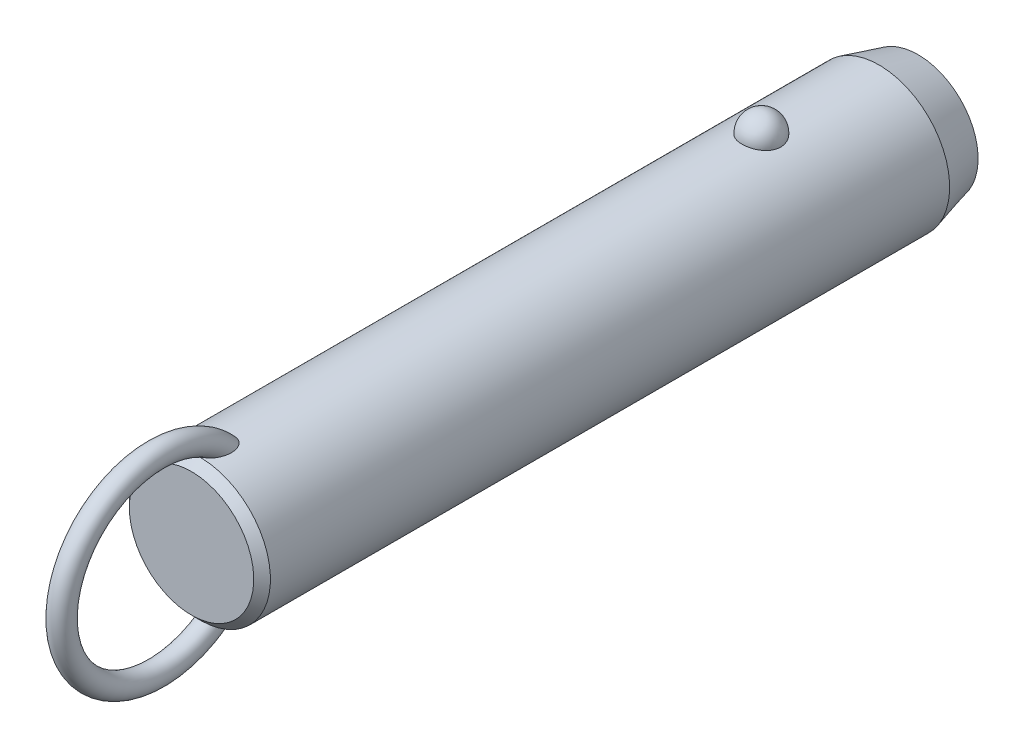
ISO-10303-21;
HEADER;
FILE_DESCRIPTION(('STEP AP214'),'2;1');
FILE_NAME('part.step','',(''),(''),'','','');
FILE_SCHEMA(('AUTOMOTIVE_DESIGN { 1 0 10303 214 1 1 1 1 }'));
ENDSEC;
DATA;
#1=APPLICATION_CONTEXT('core data for automotive mechanical design processes');
#2=APPLICATION_PROTOCOL_DEFINITION('international standard','automotive_design',2000,#1);
#3=PRODUCT_CONTEXT('',#1,'mechanical');
#4=PRODUCT('Part','Part','',(#3));
#5=PRODUCT_RELATED_PRODUCT_CATEGORY('part','',(#4));
#6=PRODUCT_DEFINITION_FORMATION('','',#4);
#7=PRODUCT_DEFINITION_CONTEXT('part definition',#1,'design');
#8=PRODUCT_DEFINITION('design','',#6,#7);
#9=PRODUCT_DEFINITION_SHAPE('','',#8);
#10=(LENGTH_UNIT() NAMED_UNIT(*) SI_UNIT(.MILLI.,.METRE.));
#11=(NAMED_UNIT(*) PLANE_ANGLE_UNIT() SI_UNIT($,.RADIAN.));
#12=(NAMED_UNIT(*) SI_UNIT($,.STERADIAN.) SOLID_ANGLE_UNIT());
#13=UNCERTAINTY_MEASURE_WITH_UNIT(LENGTH_MEASURE(1.E-05),#10,'distance_accuracy_value','');
#14=(GEOMETRIC_REPRESENTATION_CONTEXT(3) GLOBAL_UNCERTAINTY_ASSIGNED_CONTEXT((#13)) GLOBAL_UNIT_ASSIGNED_CONTEXT((#10,
#11,#12)) REPRESENTATION_CONTEXT('',''));
#15=CARTESIAN_POINT('',(0.,0.,0.));
#16=DIRECTION('',(0.,0.,1.));
#17=DIRECTION('',(1.,0.,0.));
#18=AXIS2_PLACEMENT_3D('',#15,#16,#17);
#19=CARTESIAN_POINT('',(0.,0.,86.4));
#20=DIRECTION('',(0.,0.,-1.));
#21=DIRECTION('',(-1.,0.,0.));
#22=AXIS2_PLACEMENT_3D('',#19,#20,#21);
#23=CYLINDRICAL_SURFACE('',#22,12.7);
#24=CARTESIAN_POINT('',(3.46661256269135,12.2177165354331,-3.5));
#25=CARTESIAN_POINT('',(3.4666090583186,12.2177194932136,-3.30432790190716));
#26=CARTESIAN_POINT('',(3.45063567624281,12.2222841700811,-3.10861112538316));
#27=CARTESIAN_POINT('',(3.38712451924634,12.2400345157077,-2.72271899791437));
#28=CARTESIAN_POINT('',(3.33957415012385,12.2532236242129,-2.53254588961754));
#29=CARTESIAN_POINT('',(3.2141234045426,12.286724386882,-2.16324948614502));
#30=CARTESIAN_POINT('',(3.13623639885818,12.3070329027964,-1.98412136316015));
#31=CARTESIAN_POINT('',(2.95205930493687,12.3525018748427,-1.64180592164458));
#32=CARTESIAN_POINT('',(2.84577003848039,12.3776621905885,-1.47861814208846));
#33=CARTESIAN_POINT('',(2.60688050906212,12.4301712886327,-1.17190583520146));
#34=CARTESIAN_POINT('',(2.47415697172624,12.4575299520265,-1.02847897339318));
#35=CARTESIAN_POINT('',(2.18615174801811,12.5112810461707,-0.766177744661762));
#36=CARTESIAN_POINT('',(2.03087002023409,12.5376734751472,-0.64730342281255));
#37=CARTESIAN_POINT('',(1.70237334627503,12.5864761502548,-0.437732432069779));
#38=CARTESIAN_POINT('',(1.52920948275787,12.6088972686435,-0.346958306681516));
#39=CARTESIAN_POINT('',(1.16944170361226,12.6473352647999,-0.195750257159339));
#40=CARTESIAN_POINT('',(0.982839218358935,12.663352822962,-0.135313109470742));
#41=CARTESIAN_POINT('',(0.604961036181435,12.6869706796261,-0.0473241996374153));
#42=CARTESIAN_POINT('',(0.413823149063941,12.6947125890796,-0.0192185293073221));
#43=CARTESIAN_POINT('',(0.0293827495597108,12.7014203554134,0.00517254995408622));
#44=CARTESIAN_POINT('',(-0.163919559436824,12.7003870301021,0.00146092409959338));
#45=CARTESIAN_POINT('',(-0.544374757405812,12.689735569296,-0.0373939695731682));
#46=CARTESIAN_POINT('',(-0.731575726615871,12.6802364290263,-0.0721015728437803));
#47=CARTESIAN_POINT('',(-1.09733277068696,12.6538333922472,-0.171364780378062));
#48=CARTESIAN_POINT('',(-1.27588869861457,12.6369293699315,-0.235920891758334));
#49=CARTESIAN_POINT('',(-1.6204698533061,12.5973946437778,-0.393548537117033));
#50=CARTESIAN_POINT('',(-1.78641865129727,12.5747321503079,-0.486778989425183));
#51=CARTESIAN_POINT('',(-2.10030671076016,12.5261316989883,-0.699110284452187));
#52=CARTESIAN_POINT('',(-2.24824419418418,12.5001934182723,-0.818213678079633));
#53=CARTESIAN_POINT('',(-2.52491489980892,12.4472906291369,-1.08157124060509));
#54=CARTESIAN_POINT('',(-2.65324222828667,12.4203160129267,-1.22624992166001));
#55=CARTESIAN_POINT('',(-2.88410007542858,12.3687509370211,-1.53528325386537));
#56=CARTESIAN_POINT('',(-2.98662883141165,12.3441606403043,-1.69963924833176));
#57=CARTESIAN_POINT('',(-3.16432417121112,12.2998199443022,-2.04548497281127));
#58=CARTESIAN_POINT('',(-3.23917525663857,12.2801261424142,-2.22714424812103));
#59=CARTESIAN_POINT('',(-3.35800573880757,12.248167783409,-2.6009138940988));
#60=CARTESIAN_POINT('',(-3.4019860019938,12.2359030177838,-2.79302397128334));
#61=CARTESIAN_POINT('',(-3.45784812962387,12.2202347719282,-3.18140279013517));
#62=CARTESIAN_POINT('',(-3.46986123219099,12.2167950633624,-3.37765118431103));
#63=CARTESIAN_POINT('',(-3.46186273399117,12.2190638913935,-3.76943689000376));
#64=CARTESIAN_POINT('',(-3.44185196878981,12.2247721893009,-3.96497421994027));
#65=CARTESIAN_POINT('',(-3.37048652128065,12.2446381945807,-4.34881728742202));
#66=CARTESIAN_POINT('',(-3.31928253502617,12.2587552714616,-4.53715319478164));
#67=CARTESIAN_POINT('',(-3.18693461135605,12.2938237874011,-4.90231727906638));
#68=CARTESIAN_POINT('',(-3.1057895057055,12.3147754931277,-5.07914500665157));
#69=CARTESIAN_POINT('',(-2.91506431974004,12.3613125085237,-5.41732059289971));
#70=CARTESIAN_POINT('',(-2.80533587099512,12.3869217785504,-5.57858147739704));
#71=CARTESIAN_POINT('',(-2.560414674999,12.4398525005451,-5.88013283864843));
#72=CARTESIAN_POINT('',(-2.42522099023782,12.4671740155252,-6.02042254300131));
#73=CARTESIAN_POINT('',(-2.1323357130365,12.5205965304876,-6.27662798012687));
#74=CARTESIAN_POINT('',(-1.97456596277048,12.5466928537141,-6.3924554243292));
#75=CARTESIAN_POINT('',(-1.64115839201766,12.5946384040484,-6.59583547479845));
#76=CARTESIAN_POINT('',(-1.46552179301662,12.6164879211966,-6.68339001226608));
#77=CARTESIAN_POINT('',(-1.10356050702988,12.6532533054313,-6.82682153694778));
#78=CARTESIAN_POINT('',(-0.917391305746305,12.6682500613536,-6.8830698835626));
#79=CARTESIAN_POINT('',(-0.537836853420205,12.6900288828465,-6.96386887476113));
#80=CARTESIAN_POINT('',(-0.344452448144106,12.6968119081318,-6.9884232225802));
#81=CARTESIAN_POINT('',(0.0402577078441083,12.7013667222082,-7.00496469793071));
#82=CARTESIAN_POINT('',(0.231556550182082,12.6993008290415,-6.99753844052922));
#83=CARTESIAN_POINT('',(0.610105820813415,12.6867505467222,-6.9516636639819));
#84=CARTESIAN_POINT('',(0.797356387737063,12.6762664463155,-6.913216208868));
#85=CARTESIAN_POINT('',(1.16186657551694,12.6480587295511,-6.80658431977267));
#86=CARTESIAN_POINT('',(1.33915951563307,12.6303611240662,-6.73850666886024));
#87=CARTESIAN_POINT('',(1.67968518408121,12.5896027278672,-6.5745087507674));
#88=CARTESIAN_POINT('',(1.84291705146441,12.5665416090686,-6.47858678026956));
#89=CARTESIAN_POINT('',(2.15340192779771,12.5171072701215,-6.25982455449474));
#90=CARTESIAN_POINT('',(2.30037831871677,12.4906895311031,-6.13660186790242));
#91=CARTESIAN_POINT('',(2.5717412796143,12.4376567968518,-5.86739587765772));
#92=CARTESIAN_POINT('',(2.69612388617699,12.4110417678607,-5.72140858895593));
#93=CARTESIAN_POINT('',(2.92107785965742,12.360051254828,-5.40794137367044));
#94=CARTESIAN_POINT('',(3.02121329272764,12.3357209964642,-5.24014110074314));
#95=CARTESIAN_POINT('',(3.19236291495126,12.2925446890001,-4.88969865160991));
#96=CARTESIAN_POINT('',(3.26338839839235,12.2736965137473,-4.70706226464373));
#97=CARTESIAN_POINT('',(3.36788038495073,12.245404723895,-4.35469510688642));
#98=CARTESIAN_POINT('',(3.40484026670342,12.2351018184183,-4.18605935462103));
#99=CARTESIAN_POINT('',(3.45420764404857,12.2212564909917,-3.84496058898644));
#100=CARTESIAN_POINT('',(3.46661565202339,12.2177139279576,-3.67249765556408));
#101=CARTESIAN_POINT('',(3.46661256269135,12.2177165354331,-3.5));
#102=B_SPLINE_CURVE_WITH_KNOTS('',3,(#24,#25,#26,#27,#28,#29,#30,#31,#32,#33,#34,#35,#36,#37,
#38,#39,#40,#41,#42,#43,#44,#45,#46,#47,#48,#49,#50,#51,#52,#53,#54,#55,#56,#57,#58,#59,#60,#61,
#62,#63,#64,#65,#66,#67,#68,#69,#70,#71,#72,#73,#74,#75,#76,#77,#78,#79,#80,#81,#82,#83,#84,#85,
#86,#87,#88,#89,#90,#91,#92,#93,#94,#95,#96,#97,#98,#99,#100,#101),.UNSPECIFIED.,.T.,.F.,(4,2,2,
2,2,2,2,2,2,2,2,2,2,2,2,2,2,2,2,2,2,2,2,2,2,2,2,2,2,2,2,2,2,2,2,2,2,2,4),(0.,0.586396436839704,
1.17302689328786,1.7593990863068,2.34575431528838,2.93491084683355,3.52406845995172,
4.11158733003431,4.69904375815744,5.2762784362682,5.85345931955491,6.42265312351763,
6.99185659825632,7.56427334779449,8.136746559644,8.71981013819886,9.3029135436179,
9.89247258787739,10.4820150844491,11.0691335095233,11.6562366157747,12.2405256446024,
12.8248374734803,13.412244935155,13.9996740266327,14.5891883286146,15.1786623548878,
15.7609861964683,16.3432419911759,16.914863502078,17.4864654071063,18.056024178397,
18.6256177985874,19.2037609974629,19.7820055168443,20.3699810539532,20.9577282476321,
21.4746855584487,21.9916320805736),.UNSPECIFIED.);
#103=CARTESIAN_POINT('',(3.46661256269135,12.2177165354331,-3.5));
#104=VERTEX_POINT('',#103);
#105=EDGE_CURVE('E41',#104,#104,#102,.T.);
#106=ORIENTED_EDGE('',*,*,#105,.T.);
#107=EDGE_LOOP('',(#106));
#108=FACE_BOUND('',#107,.T.);
#109=CARTESIAN_POINT('',(0.,0.,97.6000000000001));
#110=DIRECTION('',(0.,0.,1.));
#111=DIRECTION('',(1.,0.,0.));
#112=AXIS2_PLACEMENT_3D('',#109,#110,#111);
#113=CIRCLE('',#112,12.7);
#114=CARTESIAN_POINT('',(-12.7,0.,97.6000000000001));
#115=VERTEX_POINT('',#114);
#116=EDGE_CURVE('E10',#115,#115,#113,.F.);
#117=ORIENTED_EDGE('',*,*,#116,.T.);
#118=EDGE_LOOP('',(#117));
#119=FACE_BOUND('',#118,.T.);
#120=CARTESIAN_POINT('',(-0.548122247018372,-12.6881662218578,91.3432187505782));
#121=CARTESIAN_POINT('',(-0.648865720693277,-12.6838128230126,91.377926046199));
#122=CARTESIAN_POINT('',(-0.746398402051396,-12.6783867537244,91.4220428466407));
#123=CARTESIAN_POINT('',(-0.932125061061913,-12.666091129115,91.5267647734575));
#124=CARTESIAN_POINT('',(-1.02030388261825,-12.6592192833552,91.587396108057));
#125=CARTESIAN_POINT('',(-1.18487740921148,-12.6448747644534,91.721847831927));
#126=CARTESIAN_POINT('',(-1.26134296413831,-12.637406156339,91.7955825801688));
#127=CARTESIAN_POINT('',(-1.4023120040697,-12.6225412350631,91.9536045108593));
#128=CARTESIAN_POINT('',(-1.46681470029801,-12.6151449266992,92.0378923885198));
#129=CARTESIAN_POINT('',(-1.60714786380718,-12.5981718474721,92.2496577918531));
#130=CARTESIAN_POINT('',(-1.67725126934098,-12.588900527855,92.380962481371));
#131=CARTESIAN_POINT('',(-1.79536591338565,-12.5725964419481,92.6532471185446));
#132=CARTESIAN_POINT('',(-1.84333535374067,-12.5655679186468,92.7942447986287));
#133=CARTESIAN_POINT('',(-1.93422576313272,-12.5519624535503,93.1376455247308));
#134=CARTESIAN_POINT('',(-1.96788773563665,-12.5466298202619,93.3425578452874));
#135=CARTESIAN_POINT('',(-1.9941399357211,-12.542463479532,93.6517600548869));
#136=CARTESIAN_POINT('',(-1.99883864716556,-12.5417153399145,93.7552987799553));
#137=CARTESIAN_POINT('',(-2.00078003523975,-12.5414074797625,93.9624512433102));
#138=CARTESIAN_POINT('',(-1.99802449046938,-12.5418474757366,94.0660649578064));
#139=CARTESIAN_POINT('',(-1.98336733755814,-12.5441750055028,94.3103207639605));
#140=CARTESIAN_POINT('',(-1.96851430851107,-12.5465291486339,94.4507804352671));
#141=CARTESIAN_POINT('',(-1.92707089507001,-12.5529612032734,94.7299607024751));
#142=CARTESIAN_POINT('',(-1.90047458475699,-12.5570399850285,94.8686803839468));
#143=CARTESIAN_POINT('',(-1.83619120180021,-12.5666008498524,95.1434113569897));
#144=CARTESIAN_POINT('',(-1.79850828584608,-12.57208240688,95.2794236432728));
#145=CARTESIAN_POINT('',(-1.71223796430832,-12.5841228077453,95.5478421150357));
#146=CARTESIAN_POINT('',(-1.66365679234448,-12.5906810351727,95.6802503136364));
#147=CARTESIAN_POINT('',(-1.5780450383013,-12.6016176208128,95.8854887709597));
#148=CARTESIAN_POINT('',(-1.54477252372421,-12.6057501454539,95.9599149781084));
#149=CARTESIAN_POINT('',(-1.47424480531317,-12.6141930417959,96.1068393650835));
#150=CARTESIAN_POINT('',(-1.43699041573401,-12.6185033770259,96.1793379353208));
#151=CARTESIAN_POINT('',(-1.35825795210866,-12.6272207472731,96.3218926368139));
#152=CARTESIAN_POINT('',(-1.31678520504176,-12.6316276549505,96.3919517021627));
#153=CARTESIAN_POINT('',(-1.22917793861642,-12.6404532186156,96.5290705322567));
#154=CARTESIAN_POINT('',(-1.18304514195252,-12.6448718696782,96.5961313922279));
#155=CARTESIAN_POINT('',(-1.07246411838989,-12.6547893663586,96.7438741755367));
#156=CARTESIAN_POINT('',(-1.00642239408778,-12.6602600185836,96.8233844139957));
#157=CARTESIAN_POINT('',(-0.864441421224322,-12.6707460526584,96.9731698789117));
#158=CARTESIAN_POINT('',(-0.788516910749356,-12.6757620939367,97.0434585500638));
#159=CARTESIAN_POINT('',(-0.652215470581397,-12.6833591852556,97.1486801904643));
#160=CARTESIAN_POINT('',(-0.594982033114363,-12.6861973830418,97.1876241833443));
#161=CARTESIAN_POINT('',(-0.475269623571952,-12.6912445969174,97.2564899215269));
#162=CARTESIAN_POINT('',(-0.412800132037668,-12.6934547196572,97.2864275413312));
#163=CARTESIAN_POINT('',(-0.295749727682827,-12.6966636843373,97.3297565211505));
#164=CARTESIAN_POINT('',(-0.241949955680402,-12.6978134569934,97.3452188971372));
#165=CARTESIAN_POINT('',(-0.132508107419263,-12.6994261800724,97.3668845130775));
#166=CARTESIAN_POINT('',(-0.076867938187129,-12.6998898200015,97.3730970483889));
#167=CARTESIAN_POINT('',(0.0347696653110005,-12.7000752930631,97.3755838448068));
#168=CARTESIAN_POINT('',(0.0907676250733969,-12.6997954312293,97.3718353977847));
#169=CARTESIAN_POINT('',(0.20128301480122,-12.6985255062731,97.3547883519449));
#170=CARTESIAN_POINT('',(0.255799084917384,-12.6975348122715,97.3414812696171));
#171=CARTESIAN_POINT('',(0.376042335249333,-12.6946091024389,97.3020379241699));
#172=CARTESIAN_POINT('',(0.44095085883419,-12.6924943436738,97.2734492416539));
#173=CARTESIAN_POINT('',(0.565350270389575,-12.6875639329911,97.2063234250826));
#174=CARTESIAN_POINT('',(0.624828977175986,-12.6847467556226,97.1677646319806));
#175=CARTESIAN_POINT('',(0.774116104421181,-12.6767252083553,97.056949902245));
#176=CARTESIAN_POINT('',(0.859449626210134,-12.6711344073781,96.9787605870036));
#177=CARTESIAN_POINT('',(1.01789440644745,-12.6593922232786,96.810943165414));
#178=CARTESIAN_POINT('',(1.09096902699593,-12.653239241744,96.721282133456));
#179=CARTESIAN_POINT('',(1.22268793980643,-12.6411674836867,96.5402658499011));
#180=CARTESIAN_POINT('',(1.28193986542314,-12.6352572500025,96.449345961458));
#181=CARTESIAN_POINT('',(1.39259777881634,-12.6235401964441,96.2627929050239));
#182=CARTESIAN_POINT('',(1.44399707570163,-12.6177334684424,96.1671558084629));
#183=CARTESIAN_POINT('',(1.53972870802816,-12.6064093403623,95.9722738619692));
#184=CARTESIAN_POINT('',(1.58405262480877,-12.6008922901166,95.8730248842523));
#185=CARTESIAN_POINT('',(1.66600705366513,-12.5903187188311,95.6717727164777));
#186=CARTESIAN_POINT('',(1.70363651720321,-12.5852622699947,95.5697690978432));
#187=CARTESIAN_POINT('',(1.77545379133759,-12.5753406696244,95.3543580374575));
#188=CARTESIAN_POINT('',(1.80903453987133,-12.5705328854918,95.240745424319));
#189=CARTESIAN_POINT('',(1.86844163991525,-12.5618400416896,95.0114575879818));
#190=CARTESIAN_POINT('',(1.89426665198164,-12.5579551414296,94.8957820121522));
#191=CARTESIAN_POINT('',(1.9378546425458,-12.5513030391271,94.6630072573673));
#192=CARTESIAN_POINT('',(1.95562640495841,-12.5485346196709,94.5459097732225));
#193=CARTESIAN_POINT('',(1.98264463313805,-12.5442934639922,94.3107473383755));
#194=CARTESIAN_POINT('',(1.99189298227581,-12.5428204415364,94.1926826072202));
#195=CARTESIAN_POINT('',(2.00416068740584,-12.540871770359,93.8806225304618));
#196=CARTESIAN_POINT('',(1.99944433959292,-12.541631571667,93.6862290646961));
#197=CARTESIAN_POINT('',(1.96113755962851,-12.5476846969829,93.3003095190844));
#198=CARTESIAN_POINT('',(1.92758341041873,-12.5529723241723,93.1087801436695));
#199=CARTESIAN_POINT('',(1.8393434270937,-12.5661532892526,92.7822728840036));
#200=CARTESIAN_POINT('',(1.79215440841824,-12.5730485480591,92.6452499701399));
#201=CARTESIAN_POINT('',(1.67676242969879,-12.588958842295,92.380445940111));
#202=CARTESIAN_POINT('',(1.60859050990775,-12.597970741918,92.2526515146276));
#203=CARTESIAN_POINT('',(1.46583832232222,-12.6152829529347,92.0358006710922));
#204=CARTESIAN_POINT('',(1.39525727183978,-12.6233659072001,91.9441050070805));
#205=CARTESIAN_POINT('',(1.23992594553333,-12.6395676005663,91.7734854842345));
#206=CARTESIAN_POINT('',(1.15517932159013,-12.6476863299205,91.6945583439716));
#207=CARTESIAN_POINT('',(0.971995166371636,-12.6630846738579,91.5526438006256));
#208=CARTESIAN_POINT('',(0.873456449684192,-12.6703572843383,91.4897849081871));
#209=CARTESIAN_POINT('',(0.665847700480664,-12.6829569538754,91.3844870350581));
#210=CARTESIAN_POINT('',(0.556784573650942,-12.688285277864,91.3420347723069));
#211=CARTESIAN_POINT('',(0.347338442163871,-12.6956226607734,91.2844434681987));
#212=CARTESIAN_POINT('',(0.247759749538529,-12.6979816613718,91.2663996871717));
#213=CARTESIAN_POINT('',(0.047021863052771,-12.7003077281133,91.2486007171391));
#214=CARTESIAN_POINT('',(-0.054135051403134,-12.7002779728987,91.2488212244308));
#215=CARTESIAN_POINT('',(-0.221414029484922,-12.6982482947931,91.2643639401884));
#216=CARTESIAN_POINT('',(-0.288055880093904,-12.6969033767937,91.2746662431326));
#217=CARTESIAN_POINT('',(-0.419599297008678,-12.6932369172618,91.3031348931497));
#218=CARTESIAN_POINT('',(-0.484501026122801,-12.6909154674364,91.3213005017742));
#219=CARTESIAN_POINT('',(-0.548122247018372,-12.6881662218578,91.3432187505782));
#220=B_SPLINE_CURVE_WITH_KNOTS('',3,(#120,#121,#122,#123,#124,#125,#126,#127,#128,#129,#130,
#131,#132,#133,#134,#135,#136,#137,#138,#139,#140,#141,#142,#143,#144,#145,#146,#147,#148,#149,
#150,#151,#152,#153,#154,#155,#156,#157,#158,#159,#160,#161,#162,#163,#164,#165,#166,#167,#168,
#169,#170,#171,#172,#173,#174,#175,#176,#177,#178,#179,#180,#181,#182,#183,#184,#185,#186,#187,
#188,#189,#190,#191,#192,#193,#194,#195,#196,#197,#198,#199,#200,#201,#202,#203,#204,#205,#206,
#207,#208,#209,#210,#211,#212,#213,#214,#215,#216,#217,#218,#219),.UNSPECIFIED.,.T.,.F.,(4,2,2,
2,2,2,2,2,2,2,2,2,2,2,2,2,2,2,2,2,2,2,2,2,2,2,2,2,2,2,2,2,2,2,2,2,2,2,2,2,2,2,2,2,2,2,2,2,2,4),
(0.,0.319642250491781,0.639794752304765,0.957927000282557,1.27608021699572,1.72100165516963,
2.16675988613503,2.78630021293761,3.0970578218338,3.40774128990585,3.83096358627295,
4.2543996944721,4.67767724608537,5.10071330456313,5.34550297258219,5.59024267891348,
5.8346770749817,6.07902143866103,6.38891080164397,6.69834321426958,6.90560910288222,
7.11250749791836,7.27977315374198,7.44687060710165,7.61434932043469,7.78197685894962,
7.99365544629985,8.20579780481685,8.55147335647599,8.89816429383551,9.22375138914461,
9.5496143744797,9.87586224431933,10.202161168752,10.557587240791,10.9130746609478,
11.2681734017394,11.6231936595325,12.2046601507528,12.7853961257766,13.219164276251,
13.6522938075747,13.9989174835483,14.3454519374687,14.6946768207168,15.0436740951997,
15.3457513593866,15.6474266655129,15.8493051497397,16.0511646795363),.UNSPECIFIED.);
#221=CARTESIAN_POINT('',(-0.548122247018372,-12.6881662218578,91.3432187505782));
#222=VERTEX_POINT('',#221);
#223=EDGE_CURVE('E59',#222,#222,#220,.T.);
#224=ORIENTED_EDGE('',*,*,#223,.T.);
#225=EDGE_LOOP('',(#224));
#226=FACE_BOUND('',#225,.T.);
#227=CARTESIAN_POINT('',(-0.548122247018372,12.6881662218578,91.3432187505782));
#228=CARTESIAN_POINT('',(-0.459436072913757,12.6919968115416,91.312673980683));
#229=CARTESIAN_POINT('',(-0.368189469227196,12.6949996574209,91.2893913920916));
#230=CARTESIAN_POINT('',(-0.183024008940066,12.6990186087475,91.2584062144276));
#231=CARTESIAN_POINT('',(-0.0891049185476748,12.7000345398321,91.2507049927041));
#232=CARTESIAN_POINT('',(0.0987147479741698,12.6999636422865,91.2512455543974));
#233=CARTESIAN_POINT('',(0.192615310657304,12.6988761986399,91.2594920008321));
#234=CARTESIAN_POINT('',(0.37765885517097,12.6947211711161,91.2915515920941));
#235=CARTESIAN_POINT('',(0.468801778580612,12.6916535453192,91.3153650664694));
#236=CARTESIAN_POINT('',(0.645809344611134,12.6838788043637,91.3774565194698));
#237=CARTESIAN_POINT('',(0.731679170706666,12.6791733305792,91.415720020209));
#238=CARTESIAN_POINT('',(0.896315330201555,12.6686004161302,91.5051204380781));
#239=CARTESIAN_POINT('',(0.975080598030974,12.6627328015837,91.5562592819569));
#240=CARTESIAN_POINT('',(1.12963655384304,12.6499161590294,91.6736782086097));
#241=CARTESIAN_POINT('',(1.20478673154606,12.6429194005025,91.7407929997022));
#242=CARTESIAN_POINT('',(1.34448241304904,12.6288282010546,91.8852250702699));
#243=CARTESIAN_POINT('',(1.40902173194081,12.621733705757,91.9625482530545));
#244=CARTESIAN_POINT('',(1.55208211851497,12.6050877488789,92.1592475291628));
#245=CARTESIAN_POINT('',(1.62510490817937,12.5957546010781,92.2826540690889));
#246=CARTESIAN_POINT('',(1.7501904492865,12.5789823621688,92.5397690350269));
#247=CARTESIAN_POINT('',(1.80221377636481,12.5715468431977,92.673496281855));
#248=CARTESIAN_POINT('',(1.90309965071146,12.5567434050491,92.9983516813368));
#249=CARTESIAN_POINT('',(1.94342317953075,12.5504515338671,93.1921611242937));
#250=CARTESIAN_POINT('',(1.99332997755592,12.5426147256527,93.5837881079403));
#251=CARTESIAN_POINT('',(2.00285305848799,12.5410790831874,93.7816127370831));
#252=CARTESIAN_POINT('',(1.99678999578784,12.5420407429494,94.1166427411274));
#253=CARTESIAN_POINT('',(1.98794117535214,12.5434564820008,94.2540428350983));
#254=CARTESIAN_POINT('',(1.95865119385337,12.5480641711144,94.5276394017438));
#255=CARTESIAN_POINT('',(1.9382043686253,12.5512569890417,94.6638352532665));
#256=CARTESIAN_POINT('',(1.88647896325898,12.5591352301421,94.9342493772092));
#257=CARTESIAN_POINT('',(1.85518800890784,12.5638223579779,95.0684652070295));
#258=CARTESIAN_POINT('',(1.78217886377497,12.5743868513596,95.3339362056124));
#259=CARTESIAN_POINT('',(1.74046509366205,12.5802637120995,95.4651926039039));
#260=CARTESIAN_POINT('',(1.66024095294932,12.5910571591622,95.6860855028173));
#261=CARTESIAN_POINT('',(1.62434772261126,12.5957535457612,95.7766904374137));
#262=CARTESIAN_POINT('',(1.54709009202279,12.6054762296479,95.9555125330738));
#263=CARTESIAN_POINT('',(1.50572681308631,12.6105024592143,96.0437301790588));
#264=CARTESIAN_POINT('',(1.41728020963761,12.620748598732,96.2169321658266));
#265=CARTESIAN_POINT('',(1.37021377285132,12.625967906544,96.3019251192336));
#266=CARTESIAN_POINT('',(1.2696962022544,12.6364721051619,96.4680072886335));
#267=CARTESIAN_POINT('',(1.21624929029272,12.6417569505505,96.5490990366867));
#268=CARTESIAN_POINT('',(1.10304413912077,12.6521331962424,96.7047027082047));
#269=CARTESIAN_POINT('',(1.04340936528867,12.657226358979,96.7793033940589));
#270=CARTESIAN_POINT('',(0.91591933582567,12.6670906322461,96.921324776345));
#271=CARTESIAN_POINT('',(0.848064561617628,12.6718617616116,96.9887458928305));
#272=CARTESIAN_POINT('',(0.717035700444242,12.67987711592,97.1006247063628));
#273=CARTESIAN_POINT('',(0.655526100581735,12.6832377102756,97.1469970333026));
#274=CARTESIAN_POINT('',(0.525985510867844,12.6892676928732,97.2296195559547));
#275=CARTESIAN_POINT('',(0.457969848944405,12.6919386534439,97.2658927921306));
#276=CARTESIAN_POINT('',(0.334859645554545,12.695691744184,97.3166572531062));
#277=CARTESIAN_POINT('',(0.281116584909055,12.6970073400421,97.3343733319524));
#278=CARTESIAN_POINT('',(0.171425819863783,12.6989609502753,97.3606429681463));
#279=CARTESIAN_POINT('',(0.115480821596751,12.699599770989,97.3692074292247));
#280=CARTESIAN_POINT('',(0.00272618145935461,12.7001251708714,97.3762531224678));
#281=CARTESIAN_POINT('',(-0.0540859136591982,12.7000089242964,97.3746964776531));
#282=CARTESIAN_POINT('',(-0.166544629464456,12.6990328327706,97.3616005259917));
#283=CARTESIAN_POINT('',(-0.222190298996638,12.6981724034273,97.3500533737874));
#284=CARTESIAN_POINT('',(-0.342018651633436,12.695562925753,97.3149128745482));
#285=CARTESIAN_POINT('',(-0.405606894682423,12.6936676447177,97.2893322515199));
#286=CARTESIAN_POINT('',(-0.527815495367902,12.6891754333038,97.2283111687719));
#287=CARTESIAN_POINT('',(-0.586425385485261,12.6865770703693,97.1928505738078));
#288=CARTESIAN_POINT('',(-0.731842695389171,12.6792129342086,97.0914960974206));
#289=CARTESIAN_POINT('',(-0.814709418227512,12.6740767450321,97.0200395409));
#290=CARTESIAN_POINT('',(-0.969101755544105,12.6632083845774,96.8658900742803));
#291=CARTESIAN_POINT('',(-1.04059564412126,12.6574746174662,96.7831668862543));
#292=CARTESIAN_POINT('',(-1.16981116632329,12.6461638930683,96.6158096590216));
#293=CARTESIAN_POINT('',(-1.22811369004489,12.6405994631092,96.5316166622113));
#294=CARTESIAN_POINT('',(-1.33743405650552,12.6295007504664,96.3585791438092));
#295=CARTESIAN_POINT('',(-1.38844577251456,12.6239664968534,96.2697307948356));
#296=CARTESIAN_POINT('',(-1.48400702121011,12.6130898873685,96.088389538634));
#297=CARTESIAN_POINT('',(-1.52854232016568,12.6077479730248,95.9958891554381));
#298=CARTESIAN_POINT('',(-1.6115011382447,12.5974127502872,95.8081607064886));
#299=CARTESIAN_POINT('',(-1.64992317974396,12.5924195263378,95.7129319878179));
#300=CARTESIAN_POINT('',(-1.73468589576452,12.581070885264,95.4828936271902));
#301=CARTESIAN_POINT('',(-1.77831261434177,12.5749388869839,95.3470661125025));
#302=CARTESIAN_POINT('',(-1.85439734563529,12.5639437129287,95.0722128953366));
#303=CARTESIAN_POINT('',(-1.88684994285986,12.5590811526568,94.9331856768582));
#304=CARTESIAN_POINT('',(-1.94008483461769,12.550968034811,94.6530923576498));
#305=CARTESIAN_POINT('',(-1.96088706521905,12.5477147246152,94.5120301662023));
#306=CARTESIAN_POINT('',(-1.99000539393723,12.5431291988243,94.2286689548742));
#307=CARTESIAN_POINT('',(-1.99832911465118,12.5417958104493,94.0863707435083));
#308=CARTESIAN_POINT('',(-2.00166624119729,12.5412674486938,93.7576271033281));
#309=CARTESIAN_POINT('',(-1.99178843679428,12.5428579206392,93.571088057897));
#310=CARTESIAN_POINT('',(-1.9445518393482,12.5502731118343,93.2016240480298));
#311=CARTESIAN_POINT('',(-1.90724032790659,12.5560905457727,93.0186934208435));
#312=CARTESIAN_POINT('',(-1.81330718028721,12.5699462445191,92.7048488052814));
#313=CARTESIAN_POINT('',(-1.76338820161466,12.5771273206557,92.5719105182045));
#314=CARTESIAN_POINT('',(-1.64305018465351,12.593414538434,92.3156813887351));
#315=CARTESIAN_POINT('',(-1.57265346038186,12.6025185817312,92.192380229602));
#316=CARTESIAN_POINT('',(-1.42634956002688,12.6198178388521,91.9835648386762));
#317=CARTESIAN_POINT('',(-1.35423772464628,12.6278405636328,91.8953846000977));
#318=CARTESIAN_POINT('',(-1.19645664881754,12.6437632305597,91.7321079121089));
#319=CARTESIAN_POINT('',(-1.11080536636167,12.6516633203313,91.6569944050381));
#320=CARTESIAN_POINT('',(-0.947219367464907,12.6648319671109,91.5378114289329));
#321=CARTESIAN_POINT('',(-0.871624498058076,12.670300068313,91.4905414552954));
#322=CARTESIAN_POINT('',(-0.714161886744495,12.6801492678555,91.4077413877));
#323=CARTESIAN_POINT('',(-0.632295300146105,12.684530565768,91.3722091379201));
#324=CARTESIAN_POINT('',(-0.548122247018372,12.6881662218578,91.3432187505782));
#325=B_SPLINE_CURVE_WITH_KNOTS('',3,(#227,#228,#229,#230,#231,#232,#233,#234,#235,#236,#237,
#238,#239,#240,#241,#242,#243,#244,#245,#246,#247,#248,#249,#250,#251,#252,#253,#254,#255,#256,
#257,#258,#259,#260,#261,#262,#263,#264,#265,#266,#267,#268,#269,#270,#271,#272,#273,#274,#275,
#276,#277,#278,#279,#280,#281,#282,#283,#284,#285,#286,#287,#288,#289,#290,#291,#292,#293,#294,
#295,#296,#297,#298,#299,#300,#301,#302,#303,#304,#305,#306,#307,#308,#309,#310,#311,#312,#313,
#314,#315,#316,#317,#318,#319,#320,#321,#322,#323,#324),.UNSPECIFIED.,.T.,.F.,(4,2,2,2,2,2,2,2,
2,2,2,2,2,2,2,2,2,2,2,2,2,2,2,2,2,2,2,2,2,2,2,2,2,2,2,2,2,2,2,2,2,2,2,2,2,2,2,2,4),(0.,
0.281328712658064,0.562682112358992,0.844117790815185,1.12555942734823,1.40671982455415,
1.68792232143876,1.98972294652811,2.29169886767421,2.72039860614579,3.14989948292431,
3.74084916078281,4.33295293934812,4.74554109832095,5.15833092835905,5.57159335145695,
5.98468079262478,6.27722775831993,6.56971484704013,6.86135609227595,7.15280542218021,
7.43927407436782,7.72572595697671,7.95635862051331,8.18646071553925,8.35559393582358,
8.52452541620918,8.69408946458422,8.86378678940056,9.06834348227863,9.27332014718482,
9.60010414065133,9.92778432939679,10.2350252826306,10.5425229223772,10.8506864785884,
11.1589244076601,11.5867893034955,12.0148612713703,12.4421984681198,12.8692745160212,
13.4279365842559,13.9856380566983,14.4107062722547,14.8353130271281,15.1765567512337,
15.5173516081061,15.7844129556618,16.051425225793),.UNSPECIFIED.);
#326=CARTESIAN_POINT('',(-0.548122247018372,12.6881662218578,91.3432187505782));
#327=VERTEX_POINT('',#326);
#328=EDGE_CURVE('E67',#327,#327,#325,.T.);
#329=ORIENTED_EDGE('',*,*,#328,.T.);
#330=EDGE_LOOP('',(#329));
#331=FACE_BOUND('',#330,.T.);
#332=CARTESIAN_POINT('',(0.,0.,-24.7000000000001));
#333=DIRECTION('',(0.,0.,-1.));
#334=DIRECTION('',(-1.,0.,0.));
#335=AXIS2_PLACEMENT_3D('',#332,#333,#334);
#336=CIRCLE('',#335,12.7);
#337=CARTESIAN_POINT('',(-12.7,0.,-24.7000000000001));
#338=VERTEX_POINT('',#337);
#339=EDGE_CURVE('E56',#338,#338,#336,.F.);
#340=ORIENTED_EDGE('',*,*,#339,.T.);
#341=EDGE_LOOP('',(#340));
#342=FACE_BOUND('',#341,.T.);
#343=ADVANCED_FACE('F37',(#108,#119,#226,#331,#342),#23,.T.);
#344=CARTESIAN_POINT('',(0.,0.,-31.7));
#345=DIRECTION('',(0.,0.,-1.));
#346=DIRECTION('',(-1.,0.,0.));
#347=AXIS2_PLACEMENT_3D('',#344,#345,#346);
#348=PLANE('',#347);
#349=CARTESIAN_POINT('',(0.,0.,-31.7));
#350=DIRECTION('',(0.,0.,-1.));
#351=DIRECTION('',(-1.,0.,0.));
#352=AXIS2_PLACEMENT_3D('',#349,#350,#351);
#353=CIRCLE('',#352,10.8243556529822);
#354=CARTESIAN_POINT('',(-10.8243556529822,0.,-31.7));
#355=VERTEX_POINT('',#354);
#356=EDGE_CURVE('E66',#355,#355,#353,.T.);
#357=ORIENTED_EDGE('',*,*,#356,.T.);
#358=EDGE_LOOP('',(#357));
#359=FACE_BOUND('',#358,.T.);
#360=ADVANCED_FACE('F85',(#359),#348,.T.);
#361=CARTESIAN_POINT('',(0.,0.,-31.7));
#362=DIRECTION('',(0.,0.,1.));
#363=DIRECTION('',(1.,0.,0.));
#364=AXIS2_PLACEMENT_3D('',#361,#362,#363);
#365=CONICAL_SURFACE('',#364,10.8243556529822,0.261799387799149);
#366=ORIENTED_EDGE('',*,*,#339,.F.);
#367=EDGE_LOOP('',(#366));
#368=FACE_BOUND('',#367,.T.);
#369=ORIENTED_EDGE('',*,*,#356,.F.);
#370=EDGE_LOOP('',(#369));
#371=FACE_BOUND('',#370,.T.);
#372=ADVANCED_FACE('F83',(#368,#371),#365,.T.);
#373=CARTESIAN_POINT('',(0.,0.,99.1));
#374=DIRECTION('',(0.,0.,1.));
#375=DIRECTION('',(1.,0.,0.));
#376=AXIS2_PLACEMENT_3D('',#373,#374,#375);
#377=PLANE('',#376);
#378=CARTESIAN_POINT('',(0.,0.,99.1));
#379=DIRECTION('',(0.,0.,1.));
#380=DIRECTION('',(1.,0.,0.));
#381=AXIS2_PLACEMENT_3D('',#378,#379,#380);
#382=CIRCLE('',#381,11.2000000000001);
#383=CARTESIAN_POINT('',(-11.2000000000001,0.,99.1));
#384=VERTEX_POINT('',#383);
#385=EDGE_CURVE('E50',#384,#384,#382,.T.);
#386=ORIENTED_EDGE('',*,*,#385,.T.);
#387=EDGE_LOOP('',(#386));
#388=FACE_BOUND('',#387,.T.);
#389=ADVANCED_FACE('F77',(#388),#377,.T.);
#390=CARTESIAN_POINT('',(0.,0.,105.45));
#391=DIRECTION('',(1.,0.,0.));
#392=DIRECTION('',(0.,0.,-1.));
#393=AXIS2_PLACEMENT_3D('',#390,#391,#392);
#394=TOROIDAL_SURFACE('',#393,17.05,2.);
#395=ORIENTED_EDGE('',*,*,#328,.F.);
#396=EDGE_LOOP('',(#395));
#397=FACE_BOUND('',#396,.T.);
#398=ORIENTED_EDGE('',*,*,#223,.F.);
#399=EDGE_LOOP('',(#398));
#400=FACE_BOUND('',#399,.T.);
#401=ADVANCED_FACE('F73',(#397,#400),#394,.T.);
#402=CARTESIAN_POINT('',(0.,0.,99.1));
#403=DIRECTION('',(0.,0.,-1.));
#404=DIRECTION('',(-1.,0.,0.));
#405=AXIS2_PLACEMENT_3D('',#402,#403,#404);
#406=CONICAL_SURFACE('',#405,11.2000000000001,0.785398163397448);
#407=CARTESIAN_POINT('',(-12.7,0.,97.6000000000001));
#408=CARTESIAN_POINT('',(-12.684375,0.,97.6156250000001));
#409=CARTESIAN_POINT('',(-12.66875,0.,97.6312500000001));
#410=CARTESIAN_POINT('',(-12.6375,0.,97.6625000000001));
#411=CARTESIAN_POINT('',(-12.621875,0.,97.6781250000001));
#412=CARTESIAN_POINT('',(-12.590625,0.,97.7093750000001));
#413=CARTESIAN_POINT('',(-12.575,0.,97.7250000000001));
#414=CARTESIAN_POINT('',(-12.54375,0.,97.7562500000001));
#415=CARTESIAN_POINT('',(-12.528125,0.,97.7718750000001));
#416=CARTESIAN_POINT('',(-12.496875,0.,97.8031250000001));
#417=CARTESIAN_POINT('',(-12.48125,0.,97.8187500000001));
#418=CARTESIAN_POINT('',(-12.45,0.,97.8500000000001));
#419=CARTESIAN_POINT('',(-12.434375,0.,97.8656250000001));
#420=CARTESIAN_POINT('',(-12.403125,0.,97.8968750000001));
#421=CARTESIAN_POINT('',(-12.3875,0.,97.9125000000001));
#422=CARTESIAN_POINT('',(-12.35625,0.,97.9437500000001));
#423=CARTESIAN_POINT('',(-12.340625,0.,97.9593750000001));
#424=CARTESIAN_POINT('',(-12.309375,0.,97.9906250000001));
#425=CARTESIAN_POINT('',(-12.29375,0.,98.0062500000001));
#426=CARTESIAN_POINT('',(-12.2625,0.,98.0375000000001));
#427=CARTESIAN_POINT('',(-12.246875,0.,98.0531250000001));
#428=CARTESIAN_POINT('',(-12.215625,0.,98.084375));
#429=CARTESIAN_POINT('',(-12.2,0.,98.1000000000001));
#430=CARTESIAN_POINT('',(-12.16875,0.,98.1312500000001));
#431=CARTESIAN_POINT('',(-12.153125,0.,98.146875));
#432=CARTESIAN_POINT('',(-12.121875,0.,98.1781250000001));
#433=CARTESIAN_POINT('',(-12.10625,0.,98.19375));
#434=CARTESIAN_POINT('',(-12.075,0.,98.2250000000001));
#435=CARTESIAN_POINT('',(-12.059375,0.,98.240625));
#436=CARTESIAN_POINT('',(-12.028125,0.,98.271875));
#437=CARTESIAN_POINT('',(-12.0125,0.,98.2875));
#438=CARTESIAN_POINT('',(-11.98125,0.,98.31875));
#439=CARTESIAN_POINT('',(-11.965625,0.,98.334375));
#440=CARTESIAN_POINT('',(-11.934375,0.,98.365625));
#441=CARTESIAN_POINT('',(-11.91875,0.,98.38125));
#442=CARTESIAN_POINT('',(-11.8875,0.,98.4125));
#443=CARTESIAN_POINT('',(-11.871875,0.,98.428125));
#444=CARTESIAN_POINT('',(-11.840625,0.,98.459375));
#445=CARTESIAN_POINT('',(-11.825,0.,98.475));
#446=CARTESIAN_POINT('',(-11.7937500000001,0.,98.50625));
#447=CARTESIAN_POINT('',(-11.7781250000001,0.,98.521875));
#448=CARTESIAN_POINT('',(-11.7468750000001,0.,98.553125));
#449=CARTESIAN_POINT('',(-11.7312500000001,0.,98.56875));
#450=CARTESIAN_POINT('',(-11.7000000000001,0.,98.6));
#451=CARTESIAN_POINT('',(-11.6843750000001,0.,98.615625));
#452=CARTESIAN_POINT('',(-11.6531250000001,0.,98.646875));
#453=CARTESIAN_POINT('',(-11.6375000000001,0.,98.6625));
#454=CARTESIAN_POINT('',(-11.6062500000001,0.,98.69375));
#455=CARTESIAN_POINT('',(-11.5906250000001,0.,98.709375));
#456=CARTESIAN_POINT('',(-11.5593750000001,0.,98.740625));
#457=CARTESIAN_POINT('',(-11.5437500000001,0.,98.75625));
#458=CARTESIAN_POINT('',(-11.5125000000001,0.,98.7875));
#459=CARTESIAN_POINT('',(-11.4968750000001,0.,98.803125));
#460=CARTESIAN_POINT('',(-11.4656250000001,0.,98.834375));
#461=CARTESIAN_POINT('',(-11.4500000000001,0.,98.85));
#462=CARTESIAN_POINT('',(-11.4187500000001,0.,98.88125));
#463=CARTESIAN_POINT('',(-11.4031250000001,0.,98.896875));
#464=CARTESIAN_POINT('',(-11.3718750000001,0.,98.928125));
#465=CARTESIAN_POINT('',(-11.3562500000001,0.,98.94375));
#466=CARTESIAN_POINT('',(-11.3250000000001,0.,98.975));
#467=CARTESIAN_POINT('',(-11.3093750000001,0.,98.990625));
#468=CARTESIAN_POINT('',(-11.2781250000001,0.,99.021875));
#469=CARTESIAN_POINT('',(-11.2625000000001,0.,99.0375));
#470=CARTESIAN_POINT('',(-11.2312500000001,0.,99.06875));
#471=CARTESIAN_POINT('',(-11.2156250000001,0.,99.084375));
#472=CARTESIAN_POINT('',(-11.2000000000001,0.,99.1));
#473=B_SPLINE_CURVE_WITH_KNOTS('',3,(#407,#408,#409,#410,#411,#412,#413,#414,#415,#416,#417,
#418,#419,#420,#421,#422,#423,#424,#425,#426,#427,#428,#429,#430,#431,#432,#433,#434,#435,#436,
#437,#438,#439,#440,#441,#442,#443,#444,#445,#446,#447,#448,#449,#450,#451,#452,#453,#454,#455,
#456,#457,#458,#459,#460,#461,#462,#463,#464,#465,#466,#467,#468,#469,#470,#471,#472),
.UNSPECIFIED.,.F.,.F.,(4,2,2,2,2,2,2,2,2,2,2,2,2,2,2,2,2,2,2,2,2,2,2,2,2,2,2,2,2,2,2,2,4),(0.,
0.0662912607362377,0.132582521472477,0.198873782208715,0.265165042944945,0.331456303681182,
0.397747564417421,0.46403882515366,0.530330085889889,0.596621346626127,0.662912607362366,
0.729203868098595,0.795495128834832,0.861786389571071,0.92807765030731,0.994368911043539,
1.06066017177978,1.12695143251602,1.19324269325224,1.25953395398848,1.32582521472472,
1.39211647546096,1.45840773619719,1.52469899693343,1.59099025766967,1.65728151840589,
1.72357277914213,1.78986403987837,1.85615530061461,1.92244656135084,1.98873782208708,
2.05502908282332,2.12132034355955),.UNSPECIFIED.);
#474=EDGE_CURVE('BSEAM39',#115,#384,#473,.T.);
#475=ORIENTED_EDGE('',*,*,#116,.F.);
#476=ORIENTED_EDGE('',*,*,#385,.F.);
#477=ORIENTED_EDGE('',*,*,#474,.T.);
#478=ORIENTED_EDGE('',*,*,#474,.F.);
#479=EDGE_LOOP('',(#475,#477,#476,#478));
#480=FACE_BOUND('',#479,.T.);
#481=ADVANCED_FACE('F39',(#480),#406,.T.);
#482=CARTESIAN_POINT('',(0.,12.7,-3.5));
#483=DIRECTION('',(0.,1.,0.));
#484=DIRECTION('',(0.,0.,-1.));
#485=AXIS2_PLACEMENT_3D('',#482,#483,#484);
#486=SPHERICAL_SURFACE('',#485,3.5);
#487=ORIENTED_EDGE('',*,*,#105,.F.);
#488=EDGE_LOOP('',(#487));
#489=FACE_BOUND('',#488,.T.);
#490=ADVANCED_FACE('F79',(#489),#486,.T.);
#491=CLOSED_SHELL('',(#343,#360,#372,#389,#401,#481,#490));
#492=MANIFOLD_SOLID_BREP('B2',#491);
#493=ADVANCED_BREP_SHAPE_REPRESENTATION('',(#18,#492),#14);
#494=SHAPE_DEFINITION_REPRESENTATION(#9,#493);
ENDSEC;
END-ISO-10303-21;
